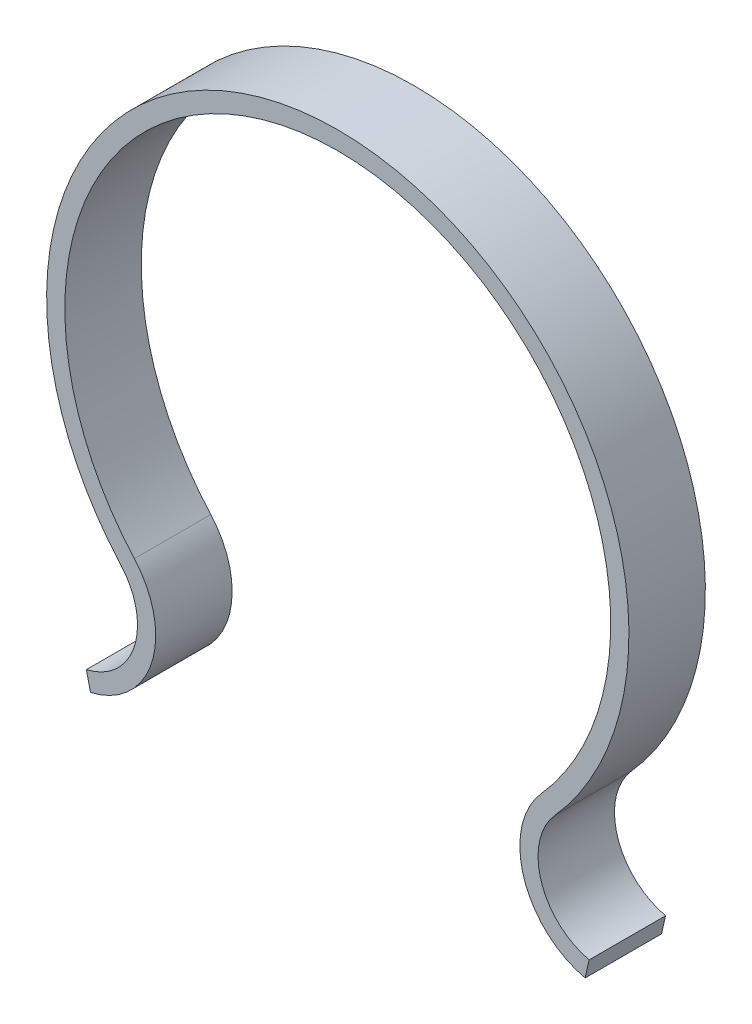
ISO-10303-21;
HEADER;
FILE_DESCRIPTION(('STEP AP214'),'2;1');
FILE_NAME('part.step','',(''),(''),'','','');
FILE_SCHEMA(('AUTOMOTIVE_DESIGN { 1 0 10303 214 1 1 1 1 }'));
ENDSEC;
DATA;
#1=APPLICATION_CONTEXT('core data for automotive mechanical design processes');
#2=APPLICATION_PROTOCOL_DEFINITION('international standard','automotive_design',2000,#1);
#3=PRODUCT_CONTEXT('',#1,'mechanical');
#4=PRODUCT('Part','Part','',(#3));
#5=PRODUCT_RELATED_PRODUCT_CATEGORY('part','',(#4));
#6=PRODUCT_DEFINITION_FORMATION('','',#4);
#7=PRODUCT_DEFINITION_CONTEXT('part definition',#1,'design');
#8=PRODUCT_DEFINITION('design','',#6,#7);
#9=PRODUCT_DEFINITION_SHAPE('','',#8);
#10=(LENGTH_UNIT() NAMED_UNIT(*) SI_UNIT(.MILLI.,.METRE.));
#11=(NAMED_UNIT(*) PLANE_ANGLE_UNIT() SI_UNIT($,.RADIAN.));
#12=(NAMED_UNIT(*) SI_UNIT($,.STERADIAN.) SOLID_ANGLE_UNIT());
#13=UNCERTAINTY_MEASURE_WITH_UNIT(LENGTH_MEASURE(1.E-05),#10,'distance_accuracy_value','');
#14=(GEOMETRIC_REPRESENTATION_CONTEXT(3) GLOBAL_UNCERTAINTY_ASSIGNED_CONTEXT((#13)) GLOBAL_UNIT_ASSIGNED_CONTEXT((#10,
#11,#12)) REPRESENTATION_CONTEXT('',''));
#15=CARTESIAN_POINT('',(0.,0.,0.));
#16=DIRECTION('',(0.,0.,1.));
#17=DIRECTION('',(1.,0.,0.));
#18=AXIS2_PLACEMENT_3D('',#15,#16,#17);
#19=CARTESIAN_POINT('',(-7.30862972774,-6.53769954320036,2.1));
#20=DIRECTION('',(0.,0.,-1.));
#21=DIRECTION('',(-1.,0.,0.));
#22=AXIS2_PLACEMENT_3D('',#19,#20,#21);
#23=CYLINDRICAL_SURFACE('',#22,1.80599733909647);
#24=CARTESIAN_POINT('',(-7.30862972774,-6.53769954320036,0.));
#25=DIRECTION('',(0.,0.,-1.));
#26=DIRECTION('',(-1.,0.,0.));
#27=AXIS2_PLACEMENT_3D('',#24,#25,#26);
#28=CIRCLE('',#27,1.80599733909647);
#29=CARTESIAN_POINT('',(-5.96257940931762,-5.33363354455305,0.));
#30=VERTEX_POINT('',#29);
#31=CARTESIAN_POINT('',(-6.90704549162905,-8.29848246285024,0.));
#32=VERTEX_POINT('',#31);
#33=EDGE_CURVE('E138',#30,#32,#28,.T.);
#34=ORIENTED_EDGE('',*,*,#33,.T.);
#35=DIRECTION('',(0.,0.,-1.));
#36=VECTOR('',#35,1.);
#37=CARTESIAN_POINT('',(-6.90704549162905,-8.29848246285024,2.1));
#38=LINE('',#37,#36);
#39=CARTESIAN_POINT('',(-6.90704549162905,-8.29848246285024,2.1));
#40=VERTEX_POINT('',#39);
#41=EDGE_CURVE('E11',#40,#32,#38,.T.);
#42=ORIENTED_EDGE('',*,*,#41,.F.);
#43=CARTESIAN_POINT('',(-7.30862972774,-6.53769954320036,2.1));
#44=DIRECTION('',(0.,0.,-1.));
#45=DIRECTION('',(-1.,0.,0.));
#46=AXIS2_PLACEMENT_3D('',#43,#44,#45);
#47=CIRCLE('',#46,1.80599733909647);
#48=CARTESIAN_POINT('',(-5.96257940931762,-5.33363354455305,2.1));
#49=VERTEX_POINT('',#48);
#50=EDGE_CURVE('E94',#49,#40,#47,.T.);
#51=ORIENTED_EDGE('',*,*,#50,.F.);
#52=DIRECTION('',(0.,0.,-1.));
#53=VECTOR('',#52,1.);
#54=CARTESIAN_POINT('',(-5.96257940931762,-5.33363354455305,2.1));
#55=LINE('',#54,#53);
#56=EDGE_CURVE('E132',#49,#30,#55,.T.);
#57=ORIENTED_EDGE('',*,*,#56,.T.);
#58=EDGE_LOOP('',(#34,#42,#51,#57));
#59=FACE_BOUND('',#58,.T.);
#60=ADVANCED_FACE('F39',(#59),#23,.F.);
#61=CARTESIAN_POINT('',(-6.79586475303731,-8.78596460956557,2.1));
#62=DIRECTION('',(-0.974964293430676,-0.222361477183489,0.));
#63=DIRECTION('',(0.222361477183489,-0.974964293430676,0.));
#64=AXIS2_PLACEMENT_3D('',#61,#62,#63);
#65=PLANE('',#64);
#66=DIRECTION('',(-0.222361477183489,0.974964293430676,0.));
#67=VECTOR('',#66,1.);
#68=CARTESIAN_POINT('',(-6.79586475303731,-8.78596460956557,0.));
#69=LINE('',#68,#67);
#70=CARTESIAN_POINT('',(-6.79586475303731,-8.78596460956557,0.));
#71=VERTEX_POINT('',#70);
#72=EDGE_CURVE('E137',#71,#32,#69,.T.);
#73=ORIENTED_EDGE('',*,*,#72,.F.);
#74=DIRECTION('',(0.,0.,-1.));
#75=VECTOR('',#74,1.);
#76=CARTESIAN_POINT('',(-6.79586475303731,-8.78596460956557,2.1));
#77=LINE('',#76,#75);
#78=CARTESIAN_POINT('',(-6.79586475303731,-8.78596460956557,2.1));
#79=VERTEX_POINT('',#78);
#80=EDGE_CURVE('E50',#79,#71,#77,.T.);
#81=ORIENTED_EDGE('',*,*,#80,.F.);
#82=DIRECTION('',(-0.222361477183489,0.974964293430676,0.));
#83=VECTOR('',#82,1.);
#84=CARTESIAN_POINT('',(-6.79586475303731,-8.78596460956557,2.1));
#85=LINE('',#84,#83);
#86=EDGE_CURVE('E176',#79,#40,#85,.T.);
#87=ORIENTED_EDGE('',*,*,#86,.T.);
#88=ORIENTED_EDGE('',*,*,#41,.T.);
#89=EDGE_LOOP('',(#73,#81,#87,#88));
#90=FACE_BOUND('',#89,.T.);
#91=ADVANCED_FACE('F166',(#90),#65,.T.);
#92=CARTESIAN_POINT('',(-7.30862972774,-6.53769954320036,2.1));
#93=DIRECTION('',(0.,0.,-1.));
#94=DIRECTION('',(-1.,0.,0.));
#95=AXIS2_PLACEMENT_3D('',#92,#93,#94);
#96=CYLINDRICAL_SURFACE('',#95,2.30599733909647);
#97=CARTESIAN_POINT('',(-7.30862972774,-6.53769954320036,0.));
#98=DIRECTION('',(0.,0.,1.));
#99=DIRECTION('',(1.,0.,0.));
#100=AXIS2_PLACEMENT_3D('',#97,#98,#99);
#101=CIRCLE('',#100,2.30599733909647);
#102=CARTESIAN_POINT('',(-5.58991819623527,-5.00028144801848,0.));
#103=VERTEX_POINT('',#102);
#104=EDGE_CURVE('E142',#103,#71,#101,.F.);
#105=ORIENTED_EDGE('',*,*,#104,.F.);
#106=DIRECTION('',(0.,0.,-1.));
#107=VECTOR('',#106,1.);
#108=CARTESIAN_POINT('',(-5.58991819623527,-5.00028144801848,2.1));
#109=LINE('',#108,#107);
#110=CARTESIAN_POINT('',(-5.58991819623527,-5.00028144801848,2.1));
#111=VERTEX_POINT('',#110);
#112=EDGE_CURVE('E157',#111,#103,#109,.T.);
#113=ORIENTED_EDGE('',*,*,#112,.F.);
#114=CARTESIAN_POINT('',(-7.30862972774,-6.53769954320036,2.1));
#115=DIRECTION('',(0.,0.,1.));
#116=DIRECTION('',(1.,0.,0.));
#117=AXIS2_PLACEMENT_3D('',#114,#115,#116);
#118=CIRCLE('',#117,2.30599733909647);
#119=EDGE_CURVE('E167',#111,#79,#118,.F.);
#120=ORIENTED_EDGE('',*,*,#119,.T.);
#121=ORIENTED_EDGE('',*,*,#80,.T.);
#122=EDGE_LOOP('',(#105,#113,#120,#121));
#123=FACE_BOUND('',#122,.T.);
#124=ADVANCED_FACE('F163',(#123),#96,.T.);
#125=CARTESIAN_POINT('',(0.,0.,2.1));
#126=DIRECTION('',(0.,0.,-1.));
#127=DIRECTION('',(-1.,0.,0.));
#128=AXIS2_PLACEMENT_3D('',#125,#126,#127);
#129=CYLINDRICAL_SURFACE('',#128,7.5);
#130=CARTESIAN_POINT('',(0.,0.,0.));
#131=DIRECTION('',(0.,0.,1.));
#132=DIRECTION('',(1.,0.,0.));
#133=AXIS2_PLACEMENT_3D('',#130,#131,#132);
#134=CIRCLE('',#133,7.5);
#135=CARTESIAN_POINT('',(5.58991819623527,-5.00028144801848,0.));
#136=VERTEX_POINT('',#135);
#137=EDGE_CURVE('E144',#136,#103,#134,.T.);
#138=ORIENTED_EDGE('',*,*,#137,.F.);
#139=DIRECTION('',(0.,0.,-1.));
#140=VECTOR('',#139,1.);
#141=CARTESIAN_POINT('',(5.58991819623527,-5.00028144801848,2.1));
#142=LINE('',#141,#140);
#143=CARTESIAN_POINT('',(5.58991819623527,-5.00028144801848,2.1));
#144=VERTEX_POINT('',#143);
#145=EDGE_CURVE('E160',#144,#136,#142,.T.);
#146=ORIENTED_EDGE('',*,*,#145,.F.);
#147=CARTESIAN_POINT('',(0.,0.,2.1));
#148=DIRECTION('',(0.,0.,1.));
#149=DIRECTION('',(1.,0.,0.));
#150=AXIS2_PLACEMENT_3D('',#147,#148,#149);
#151=CIRCLE('',#150,7.5);
#152=EDGE_CURVE('E128',#144,#111,#151,.T.);
#153=ORIENTED_EDGE('',*,*,#152,.T.);
#154=ORIENTED_EDGE('',*,*,#112,.T.);
#155=EDGE_LOOP('',(#138,#146,#153,#154));
#156=FACE_BOUND('',#155,.T.);
#157=ADVANCED_FACE('F178',(#156),#129,.F.);
#158=CARTESIAN_POINT('',(7.30862972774,-6.53769954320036,2.1));
#159=DIRECTION('',(0.,0.,-1.));
#160=DIRECTION('',(-1.,0.,0.));
#161=AXIS2_PLACEMENT_3D('',#158,#159,#160);
#162=CYLINDRICAL_SURFACE('',#161,2.30599733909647);
#163=CARTESIAN_POINT('',(7.30862972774,-6.53769954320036,0.));
#164=DIRECTION('',(0.,0.,1.));
#165=DIRECTION('',(1.,0.,0.));
#166=AXIS2_PLACEMENT_3D('',#163,#164,#165);
#167=CIRCLE('',#166,2.30599733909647);
#168=CARTESIAN_POINT('',(6.79586475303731,-8.78596460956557,0.));
#169=VERTEX_POINT('',#168);
#170=EDGE_CURVE('E146',#169,#136,#167,.F.);
#171=ORIENTED_EDGE('',*,*,#170,.F.);
#172=DIRECTION('',(0.,0.,-1.));
#173=VECTOR('',#172,1.);
#174=CARTESIAN_POINT('',(6.79586475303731,-8.78596460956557,2.1));
#175=LINE('',#174,#173);
#176=CARTESIAN_POINT('',(6.79586475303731,-8.78596460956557,2.1));
#177=VERTEX_POINT('',#176);
#178=EDGE_CURVE('E120',#177,#169,#175,.T.);
#179=ORIENTED_EDGE('',*,*,#178,.F.);
#180=CARTESIAN_POINT('',(7.30862972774,-6.53769954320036,2.1));
#181=DIRECTION('',(0.,0.,1.));
#182=DIRECTION('',(1.,0.,0.));
#183=AXIS2_PLACEMENT_3D('',#180,#181,#182);
#184=CIRCLE('',#183,2.30599733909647);
#185=EDGE_CURVE('E126',#177,#144,#184,.F.);
#186=ORIENTED_EDGE('',*,*,#185,.T.);
#187=ORIENTED_EDGE('',*,*,#145,.T.);
#188=EDGE_LOOP('',(#171,#179,#186,#187));
#189=FACE_BOUND('',#188,.T.);
#190=ADVANCED_FACE('F181',(#189),#162,.T.);
#191=CARTESIAN_POINT('',(6.90704549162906,-8.29848246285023,2.1));
#192=DIRECTION('',(0.974964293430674,-0.222361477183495,0.));
#193=DIRECTION('',(0.222361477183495,0.974964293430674,0.));
#194=AXIS2_PLACEMENT_3D('',#191,#192,#193);
#195=PLANE('',#194);
#196=DIRECTION('',(-0.222361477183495,-0.974964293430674,0.));
#197=VECTOR('',#196,1.);
#198=CARTESIAN_POINT('',(6.90704549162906,-8.29848246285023,0.));
#199=LINE('',#198,#197);
#200=CARTESIAN_POINT('',(6.90704549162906,-8.29848246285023,0.));
#201=VERTEX_POINT('',#200);
#202=EDGE_CURVE('E116',#201,#169,#199,.T.);
#203=ORIENTED_EDGE('',*,*,#202,.F.);
#204=DIRECTION('',(0.,0.,-1.));
#205=VECTOR('',#204,1.);
#206=CARTESIAN_POINT('',(6.90704549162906,-8.29848246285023,2.1));
#207=LINE('',#206,#205);
#208=CARTESIAN_POINT('',(6.90704549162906,-8.29848246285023,2.1));
#209=VERTEX_POINT('',#208);
#210=EDGE_CURVE('E112',#209,#201,#207,.T.);
#211=ORIENTED_EDGE('',*,*,#210,.F.);
#212=DIRECTION('',(-0.222361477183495,-0.974964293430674,0.));
#213=VECTOR('',#212,1.);
#214=CARTESIAN_POINT('',(6.90704549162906,-8.29848246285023,2.1));
#215=LINE('',#214,#213);
#216=EDGE_CURVE('E113',#209,#177,#215,.T.);
#217=ORIENTED_EDGE('',*,*,#216,.T.);
#218=ORIENTED_EDGE('',*,*,#178,.T.);
#219=EDGE_LOOP('',(#203,#211,#217,#218));
#220=FACE_BOUND('',#219,.T.);
#221=ADVANCED_FACE('F114',(#220),#195,.T.);
#222=CARTESIAN_POINT('',(7.30862972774,-6.53769954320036,2.1));
#223=DIRECTION('',(0.,0.,-1.));
#224=DIRECTION('',(-1.,0.,0.));
#225=AXIS2_PLACEMENT_3D('',#222,#223,#224);
#226=CYLINDRICAL_SURFACE('',#225,1.80599733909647);
#227=CARTESIAN_POINT('',(7.30862972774,-6.53769954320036,0.));
#228=DIRECTION('',(0.,0.,-1.));
#229=DIRECTION('',(1.,0.,0.));
#230=AXIS2_PLACEMENT_3D('',#227,#228,#229);
#231=CIRCLE('',#230,1.80599733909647);
#232=CARTESIAN_POINT('',(5.96257940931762,-5.33363354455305,0.));
#233=VERTEX_POINT('',#232);
#234=EDGE_CURVE('E85',#201,#233,#231,.T.);
#235=ORIENTED_EDGE('',*,*,#234,.T.);
#236=DIRECTION('',(0.,0.,-1.));
#237=VECTOR('',#236,1.);
#238=CARTESIAN_POINT('',(5.96257940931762,-5.33363354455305,2.1));
#239=LINE('',#238,#237);
#240=CARTESIAN_POINT('',(5.96257940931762,-5.33363354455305,2.1));
#241=VERTEX_POINT('',#240);
#242=EDGE_CURVE('E118',#241,#233,#239,.T.);
#243=ORIENTED_EDGE('',*,*,#242,.F.);
#244=CARTESIAN_POINT('',(7.30862972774,-6.53769954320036,2.1));
#245=DIRECTION('',(0.,0.,-1.));
#246=DIRECTION('',(1.,0.,0.));
#247=AXIS2_PLACEMENT_3D('',#244,#245,#246);
#248=CIRCLE('',#247,1.80599733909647);
#249=EDGE_CURVE('E123',#209,#241,#248,.T.);
#250=ORIENTED_EDGE('',*,*,#249,.F.);
#251=ORIENTED_EDGE('',*,*,#210,.T.);
#252=EDGE_LOOP('',(#235,#243,#250,#251));
#253=FACE_BOUND('',#252,.T.);
#254=ADVANCED_FACE('F125',(#253),#226,.F.);
#255=CARTESIAN_POINT('',(0.,0.,2.1));
#256=DIRECTION('',(0.,0.,-1.));
#257=DIRECTION('',(-1.,0.,0.));
#258=AXIS2_PLACEMENT_3D('',#255,#256,#257);
#259=CYLINDRICAL_SURFACE('',#258,8.);
#260=CARTESIAN_POINT('',(0.,0.,0.));
#261=DIRECTION('',(0.,0.,1.));
#262=DIRECTION('',(-1.,0.,0.));
#263=AXIS2_PLACEMENT_3D('',#260,#261,#262);
#264=CIRCLE('',#263,8.);
#265=EDGE_CURVE('E86',#233,#30,#264,.T.);
#266=ORIENTED_EDGE('',*,*,#265,.T.);
#267=ORIENTED_EDGE('',*,*,#56,.F.);
#268=CARTESIAN_POINT('',(0.,0.,2.1));
#269=DIRECTION('',(0.,0.,1.));
#270=DIRECTION('',(-1.,0.,0.));
#271=AXIS2_PLACEMENT_3D('',#268,#269,#270);
#272=CIRCLE('',#271,8.);
#273=EDGE_CURVE('E54',#241,#49,#272,.T.);
#274=ORIENTED_EDGE('',*,*,#273,.F.);
#275=ORIENTED_EDGE('',*,*,#242,.T.);
#276=EDGE_LOOP('',(#266,#267,#274,#275));
#277=FACE_BOUND('',#276,.T.);
#278=ADVANCED_FACE('F183',(#277),#259,.T.);
#279=CARTESIAN_POINT('',(-7.30862972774,-6.53769954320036,2.1));
#280=DIRECTION('',(0.,0.,-1.));
#281=DIRECTION('',(-1.,0.,0.));
#282=AXIS2_PLACEMENT_3D('',#279,#280,#281);
#283=PLANE('',#282);
#284=ORIENTED_EDGE('',*,*,#50,.T.);
#285=ORIENTED_EDGE('',*,*,#86,.F.);
#286=ORIENTED_EDGE('',*,*,#119,.F.);
#287=ORIENTED_EDGE('',*,*,#152,.F.);
#288=ORIENTED_EDGE('',*,*,#185,.F.);
#289=ORIENTED_EDGE('',*,*,#216,.F.);
#290=ORIENTED_EDGE('',*,*,#249,.T.);
#291=ORIENTED_EDGE('',*,*,#273,.T.);
#292=EDGE_LOOP('',(#284,#285,#286,#287,#288,#289,#290,#291));
#293=FACE_BOUND('',#292,.T.);
#294=ADVANCED_FACE('F124',(#293),#283,.F.);
#295=CARTESIAN_POINT('',(-7.30862972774,-6.53769954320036,0.));
#296=DIRECTION('',(0.,0.,-1.));
#297=DIRECTION('',(-1.,0.,0.));
#298=AXIS2_PLACEMENT_3D('',#295,#296,#297);
#299=PLANE('',#298);
#300=ORIENTED_EDGE('',*,*,#33,.F.);
#301=ORIENTED_EDGE('',*,*,#265,.F.);
#302=ORIENTED_EDGE('',*,*,#234,.F.);
#303=ORIENTED_EDGE('',*,*,#202,.T.);
#304=ORIENTED_EDGE('',*,*,#170,.T.);
#305=ORIENTED_EDGE('',*,*,#137,.T.);
#306=ORIENTED_EDGE('',*,*,#104,.T.);
#307=ORIENTED_EDGE('',*,*,#72,.T.);
#308=EDGE_LOOP('',(#300,#301,#302,#303,#304,#305,#306,#307));
#309=FACE_BOUND('',#308,.T.);
#310=ADVANCED_FACE('F171',(#309),#299,.T.);
#311=CLOSED_SHELL('',(#60,#91,#124,#157,#190,#221,#254,#278,#294,#310));
#312=MANIFOLD_SOLID_BREP('B2',#311);
#313=ADVANCED_BREP_SHAPE_REPRESENTATION('',(#18,#312),#14);
#314=SHAPE_DEFINITION_REPRESENTATION(#9,#313);
ENDSEC;
END-ISO-10303-21;
